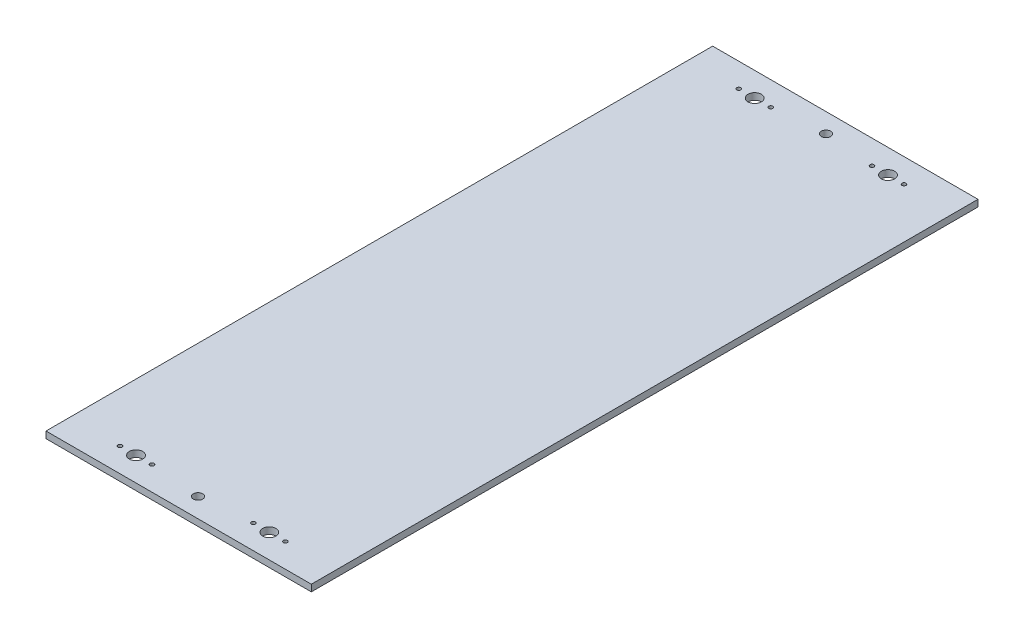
ISO-10303-21;
HEADER;
FILE_DESCRIPTION(('STEP AP214'),'2;1');
FILE_NAME('part.step','',(''),(''),'','','');
FILE_SCHEMA(('AUTOMOTIVE_DESIGN { 1 0 10303 214 1 1 1 1 }'));
ENDSEC;
DATA;
#1=APPLICATION_CONTEXT('core data for automotive mechanical design processes');
#2=APPLICATION_PROTOCOL_DEFINITION('international standard','automotive_design',2000,#1);
#3=PRODUCT_CONTEXT('',#1,'mechanical');
#4=PRODUCT('Part','Part','',(#3));
#5=PRODUCT_RELATED_PRODUCT_CATEGORY('part','',(#4));
#6=PRODUCT_DEFINITION_FORMATION('','',#4);
#7=PRODUCT_DEFINITION_CONTEXT('part definition',#1,'design');
#8=PRODUCT_DEFINITION('design','',#6,#7);
#9=PRODUCT_DEFINITION_SHAPE('','',#8);
#10=(LENGTH_UNIT() NAMED_UNIT(*) SI_UNIT(.MILLI.,.METRE.));
#11=(NAMED_UNIT(*) PLANE_ANGLE_UNIT() SI_UNIT($,.RADIAN.));
#12=(NAMED_UNIT(*) SI_UNIT($,.STERADIAN.) SOLID_ANGLE_UNIT());
#13=UNCERTAINTY_MEASURE_WITH_UNIT(LENGTH_MEASURE(1.E-05),#10,'distance_accuracy_value','');
#14=(GEOMETRIC_REPRESENTATION_CONTEXT(3) GLOBAL_UNCERTAINTY_ASSIGNED_CONTEXT((#13)) GLOBAL_UNIT_ASSIGNED_CONTEXT((#10,
#11,#12)) REPRESENTATION_CONTEXT('',''));
#15=CARTESIAN_POINT('',(0.,0.,0.));
#16=DIRECTION('',(0.,0.,1.));
#17=DIRECTION('',(1.,0.,0.));
#18=AXIS2_PLACEMENT_3D('',#15,#16,#17);
#19=CARTESIAN_POINT('',(-199.,10.,-500.));
#20=DIRECTION('',(1.,0.,0.));
#21=DIRECTION('',(0.,0.,-1.));
#22=AXIS2_PLACEMENT_3D('',#19,#20,#21);
#23=PLANE('',#22);
#24=DIRECTION('',(0.,0.,1.));
#25=VECTOR('',#24,1.);
#26=CARTESIAN_POINT('',(-199.,0.,-500.));
#27=LINE('',#26,#25);
#28=CARTESIAN_POINT('',(-199.,0.,-500.));
#29=VERTEX_POINT('',#28);
#30=CARTESIAN_POINT('',(-199.,0.,500.));
#31=VERTEX_POINT('',#30);
#32=EDGE_CURVE('E98',#29,#31,#27,.T.);
#33=ORIENTED_EDGE('',*,*,#32,.T.);
#34=DIRECTION('',(0.,-1.,0.));
#35=VECTOR('',#34,1.);
#36=CARTESIAN_POINT('',(-199.,10.,500.));
#37=LINE('',#36,#35);
#38=CARTESIAN_POINT('',(-199.,10.,500.));
#39=VERTEX_POINT('',#38);
#40=EDGE_CURVE('E11',#39,#31,#37,.T.);
#41=ORIENTED_EDGE('',*,*,#40,.F.);
#42=DIRECTION('',(0.,0.,1.));
#43=VECTOR('',#42,1.);
#44=CARTESIAN_POINT('',(-199.,10.,-500.));
#45=LINE('',#44,#43);
#46=CARTESIAN_POINT('',(-199.,10.,-500.));
#47=VERTEX_POINT('',#46);
#48=EDGE_CURVE('E86',#47,#39,#45,.T.);
#49=ORIENTED_EDGE('',*,*,#48,.F.);
#50=DIRECTION('',(0.,-1.,0.));
#51=VECTOR('',#50,1.);
#52=CARTESIAN_POINT('',(-199.,10.,-500.));
#53=LINE('',#52,#51);
#54=EDGE_CURVE('E94',#47,#29,#53,.T.);
#55=ORIENTED_EDGE('',*,*,#54,.T.);
#56=EDGE_LOOP('',(#33,#41,#49,#55));
#57=FACE_BOUND('',#56,.T.);
#58=ADVANCED_FACE('F35',(#57),#23,.F.);
#59=CARTESIAN_POINT('',(199.,10.,500.));
#60=DIRECTION('',(0.,0.,-1.));
#61=DIRECTION('',(-1.,0.,0.));
#62=AXIS2_PLACEMENT_3D('',#59,#60,#61);
#63=PLANE('',#62);
#64=DIRECTION('',(1.,0.,0.));
#65=VECTOR('',#64,1.);
#66=CARTESIAN_POINT('',(199.,0.,500.));
#67=LINE('',#66,#65);
#68=CARTESIAN_POINT('',(199.,0.,500.));
#69=VERTEX_POINT('',#68);
#70=EDGE_CURVE('E90',#31,#69,#67,.T.);
#71=ORIENTED_EDGE('',*,*,#70,.T.);
#72=DIRECTION('',(0.,-1.,0.));
#73=VECTOR('',#72,1.);
#74=CARTESIAN_POINT('',(199.,10.,500.));
#75=LINE('',#74,#73);
#76=CARTESIAN_POINT('',(199.,10.,500.));
#77=VERTEX_POINT('',#76);
#78=EDGE_CURVE('E43',#77,#69,#75,.T.);
#79=ORIENTED_EDGE('',*,*,#78,.F.);
#80=DIRECTION('',(1.,0.,0.));
#81=VECTOR('',#80,1.);
#82=CARTESIAN_POINT('',(199.,10.,500.));
#83=LINE('',#82,#81);
#84=EDGE_CURVE('E81',#39,#77,#83,.T.);
#85=ORIENTED_EDGE('',*,*,#84,.F.);
#86=ORIENTED_EDGE('',*,*,#40,.T.);
#87=EDGE_LOOP('',(#71,#79,#85,#86));
#88=FACE_BOUND('',#87,.T.);
#89=ADVANCED_FACE('F89',(#88),#63,.F.);
#90=CARTESIAN_POINT('',(199.,10.,-500.));
#91=DIRECTION('',(-1.,0.,0.));
#92=DIRECTION('',(0.,0.,1.));
#93=AXIS2_PLACEMENT_3D('',#90,#91,#92);
#94=PLANE('',#93);
#95=DIRECTION('',(0.,0.,-1.));
#96=VECTOR('',#95,1.);
#97=CARTESIAN_POINT('',(199.,0.,-500.));
#98=LINE('',#97,#96);
#99=CARTESIAN_POINT('',(199.,0.,-500.));
#100=VERTEX_POINT('',#99);
#101=EDGE_CURVE('E68',#69,#100,#98,.T.);
#102=ORIENTED_EDGE('',*,*,#101,.T.);
#103=DIRECTION('',(0.,-1.,0.));
#104=VECTOR('',#103,1.);
#105=CARTESIAN_POINT('',(199.,10.,-500.));
#106=LINE('',#105,#104);
#107=CARTESIAN_POINT('',(199.,10.,-500.));
#108=VERTEX_POINT('',#107);
#109=EDGE_CURVE('E91',#108,#100,#106,.T.);
#110=ORIENTED_EDGE('',*,*,#109,.F.);
#111=DIRECTION('',(0.,0.,-1.));
#112=VECTOR('',#111,1.);
#113=CARTESIAN_POINT('',(199.,10.,-500.));
#114=LINE('',#113,#112);
#115=EDGE_CURVE('E84',#77,#108,#114,.T.);
#116=ORIENTED_EDGE('',*,*,#115,.F.);
#117=ORIENTED_EDGE('',*,*,#78,.T.);
#118=EDGE_LOOP('',(#102,#110,#116,#117));
#119=FACE_BOUND('',#118,.T.);
#120=ADVANCED_FACE('F92',(#119),#94,.F.);
#121=CARTESIAN_POINT('',(199.,10.,-500.));
#122=DIRECTION('',(0.,0.,1.));
#123=DIRECTION('',(1.,0.,0.));
#124=AXIS2_PLACEMENT_3D('',#121,#122,#123);
#125=PLANE('',#124);
#126=DIRECTION('',(-1.,0.,0.));
#127=VECTOR('',#126,1.);
#128=CARTESIAN_POINT('',(199.,0.,-500.));
#129=LINE('',#128,#127);
#130=EDGE_CURVE('E74',#100,#29,#129,.T.);
#131=ORIENTED_EDGE('',*,*,#130,.T.);
#132=ORIENTED_EDGE('',*,*,#54,.F.);
#133=DIRECTION('',(-1.,0.,0.));
#134=VECTOR('',#133,1.);
#135=CARTESIAN_POINT('',(199.,10.,-500.));
#136=LINE('',#135,#134);
#137=EDGE_CURVE('E51',#108,#47,#136,.T.);
#138=ORIENTED_EDGE('',*,*,#137,.F.);
#139=ORIENTED_EDGE('',*,*,#109,.T.);
#140=EDGE_LOOP('',(#131,#132,#138,#139));
#141=FACE_BOUND('',#140,.T.);
#142=ADVANCED_FACE('F106',(#141),#125,.F.);
#143=CARTESIAN_POINT('',(0.,10.,0.));
#144=DIRECTION('',(0.,-1.,0.));
#145=DIRECTION('',(0.,0.,-1.));
#146=AXIS2_PLACEMENT_3D('',#143,#144,#145);
#147=PLANE('',#146);
#148=CARTESIAN_POINT('',(124.,10.,-464.));
#149=DIRECTION('',(0.,1.,0.));
#150=DIRECTION('',(0.,0.,1.));
#151=AXIS2_PLACEMENT_3D('',#148,#149,#150);
#152=CIRCLE('',#151,2.99999999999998);
#153=CARTESIAN_POINT('',(124.,10.,-461.));
#154=VERTEX_POINT('',#153);
#155=EDGE_CURVE('E137',#154,#154,#152,.T.);
#156=ORIENTED_EDGE('',*,*,#155,.F.);
#157=EDGE_LOOP('',(#156));
#158=FACE_BOUND('',#157,.T.);
#159=CARTESIAN_POINT('',(76.0000000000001,10.,-464.));
#160=DIRECTION('',(0.,1.,0.));
#161=DIRECTION('',(0.,0.,1.));
#162=AXIS2_PLACEMENT_3D('',#159,#160,#161);
#163=CIRCLE('',#162,3.00000000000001);
#164=CARTESIAN_POINT('',(76.0000000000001,10.,-461.));
#165=VERTEX_POINT('',#164);
#166=EDGE_CURVE('E184',#165,#165,#163,.T.);
#167=ORIENTED_EDGE('',*,*,#166,.F.);
#168=EDGE_LOOP('',(#167));
#169=FACE_BOUND('',#168,.T.);
#170=CARTESIAN_POINT('',(-76.0000000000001,10.,-464.));
#171=DIRECTION('',(0.,1.,0.));
#172=DIRECTION('',(0.,0.,1.));
#173=AXIS2_PLACEMENT_3D('',#170,#171,#172);
#174=CIRCLE('',#173,2.99999999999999);
#175=CARTESIAN_POINT('',(-76.0000000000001,10.,-461.));
#176=VERTEX_POINT('',#175);
#177=EDGE_CURVE('E190',#176,#176,#174,.T.);
#178=ORIENTED_EDGE('',*,*,#177,.F.);
#179=EDGE_LOOP('',(#178));
#180=FACE_BOUND('',#179,.T.);
#181=CARTESIAN_POINT('',(-124.,10.,-464.));
#182=DIRECTION('',(0.,1.,0.));
#183=DIRECTION('',(0.,0.,1.));
#184=AXIS2_PLACEMENT_3D('',#181,#182,#183);
#185=CIRCLE('',#184,2.99999999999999);
#186=CARTESIAN_POINT('',(-124.,10.,-461.));
#187=VERTEX_POINT('',#186);
#188=EDGE_CURVE('E161',#187,#187,#185,.T.);
#189=ORIENTED_EDGE('',*,*,#188,.F.);
#190=EDGE_LOOP('',(#189));
#191=FACE_BOUND('',#190,.T.);
#192=CARTESIAN_POINT('',(0.,10.,-471.));
#193=DIRECTION('',(0.,1.,0.));
#194=DIRECTION('',(0.,0.,1.));
#195=AXIS2_PLACEMENT_3D('',#192,#193,#194);
#196=CIRCLE('',#195,7.);
#197=CARTESIAN_POINT('',(0.,10.,-464.));
#198=VERTEX_POINT('',#197);
#199=EDGE_CURVE('E168',#198,#198,#196,.T.);
#200=ORIENTED_EDGE('',*,*,#199,.F.);
#201=EDGE_LOOP('',(#200));
#202=FACE_BOUND('',#201,.T.);
#203=CARTESIAN_POINT('',(100.,10.,-464.));
#204=DIRECTION('',(0.,1.,0.));
#205=DIRECTION('',(0.,0.,1.));
#206=AXIS2_PLACEMENT_3D('',#203,#204,#205);
#207=CIRCLE('',#206,10.);
#208=CARTESIAN_POINT('',(100.,10.,-454.));
#209=VERTEX_POINT('',#208);
#210=EDGE_CURVE('E174',#209,#209,#207,.T.);
#211=ORIENTED_EDGE('',*,*,#210,.F.);
#212=EDGE_LOOP('',(#211));
#213=FACE_BOUND('',#212,.T.);
#214=CARTESIAN_POINT('',(-124.,10.,464.));
#215=DIRECTION('',(0.,1.,0.));
#216=DIRECTION('',(0.,0.,-1.));
#217=AXIS2_PLACEMENT_3D('',#214,#215,#216);
#218=CIRCLE('',#217,2.99999999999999);
#219=CARTESIAN_POINT('',(-124.,10.,461.));
#220=VERTEX_POINT('',#219);
#221=EDGE_CURVE('E145',#220,#220,#218,.T.);
#222=ORIENTED_EDGE('',*,*,#221,.F.);
#223=EDGE_LOOP('',(#222));
#224=FACE_BOUND('',#223,.T.);
#225=CARTESIAN_POINT('',(0.,10.,471.));
#226=DIRECTION('',(0.,1.,0.));
#227=DIRECTION('',(0.,0.,-1.));
#228=AXIS2_PLACEMENT_3D('',#225,#226,#227);
#229=CIRCLE('',#228,7.);
#230=CARTESIAN_POINT('',(0.,10.,464.));
#231=VERTEX_POINT('',#230);
#232=EDGE_CURVE('E138',#231,#231,#229,.T.);
#233=ORIENTED_EDGE('',*,*,#232,.F.);
#234=EDGE_LOOP('',(#233));
#235=FACE_BOUND('',#234,.T.);
#236=CARTESIAN_POINT('',(100.,10.,464.));
#237=DIRECTION('',(0.,1.,0.));
#238=DIRECTION('',(0.,0.,-1.));
#239=AXIS2_PLACEMENT_3D('',#236,#237,#238);
#240=CIRCLE('',#239,10.);
#241=CARTESIAN_POINT('',(100.,10.,454.));
#242=VERTEX_POINT('',#241);
#243=EDGE_CURVE('E156',#242,#242,#240,.T.);
#244=ORIENTED_EDGE('',*,*,#243,.F.);
#245=EDGE_LOOP('',(#244));
#246=FACE_BOUND('',#245,.T.);
#247=CARTESIAN_POINT('',(-99.9999999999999,10.,464.));
#248=DIRECTION('',(0.,1.,0.));
#249=DIRECTION('',(0.,0.,-1.));
#250=AXIS2_PLACEMENT_3D('',#247,#248,#249);
#251=CIRCLE('',#250,10.);
#252=CARTESIAN_POINT('',(-99.9999999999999,10.,454.));
#253=VERTEX_POINT('',#252);
#254=EDGE_CURVE('E150',#253,#253,#251,.T.);
#255=ORIENTED_EDGE('',*,*,#254,.F.);
#256=EDGE_LOOP('',(#255));
#257=FACE_BOUND('',#256,.T.);
#258=CARTESIAN_POINT('',(-76.0000000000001,10.,464.));
#259=DIRECTION('',(0.,1.,0.));
#260=DIRECTION('',(0.,0.,-1.));
#261=AXIS2_PLACEMENT_3D('',#258,#259,#260);
#262=CIRCLE('',#261,2.99999999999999);
#263=CARTESIAN_POINT('',(-76.0000000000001,10.,461.));
#264=VERTEX_POINT('',#263);
#265=EDGE_CURVE('E118',#264,#264,#262,.T.);
#266=ORIENTED_EDGE('',*,*,#265,.F.);
#267=EDGE_LOOP('',(#266));
#268=FACE_BOUND('',#267,.T.);
#269=CARTESIAN_POINT('',(76.0000000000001,10.,464.));
#270=DIRECTION('',(0.,1.,0.));
#271=DIRECTION('',(0.,0.,-1.));
#272=AXIS2_PLACEMENT_3D('',#269,#270,#271);
#273=CIRCLE('',#272,3.00000000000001);
#274=CARTESIAN_POINT('',(76.0000000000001,10.,461.));
#275=VERTEX_POINT('',#274);
#276=EDGE_CURVE('E125',#275,#275,#273,.T.);
#277=ORIENTED_EDGE('',*,*,#276,.F.);
#278=EDGE_LOOP('',(#277));
#279=FACE_BOUND('',#278,.T.);
#280=CARTESIAN_POINT('',(124.,10.,464.));
#281=DIRECTION('',(0.,1.,0.));
#282=DIRECTION('',(0.,0.,-1.));
#283=AXIS2_PLACEMENT_3D('',#280,#281,#282);
#284=CIRCLE('',#283,2.99999999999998);
#285=CARTESIAN_POINT('',(124.,10.,461.));
#286=VERTEX_POINT('',#285);
#287=EDGE_CURVE('E131',#286,#286,#284,.T.);
#288=ORIENTED_EDGE('',*,*,#287,.F.);
#289=EDGE_LOOP('',(#288));
#290=FACE_BOUND('',#289,.T.);
#291=CARTESIAN_POINT('',(-99.9999999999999,10.,-464.));
#292=DIRECTION('',(0.,1.,0.));
#293=DIRECTION('',(0.,0.,1.));
#294=AXIS2_PLACEMENT_3D('',#291,#292,#293);
#295=CIRCLE('',#294,10.);
#296=CARTESIAN_POINT('',(-99.9999999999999,10.,-454.));
#297=VERTEX_POINT('',#296);
#298=EDGE_CURVE('E112',#297,#297,#295,.T.);
#299=ORIENTED_EDGE('',*,*,#298,.F.);
#300=EDGE_LOOP('',(#299));
#301=FACE_BOUND('',#300,.T.);
#302=ORIENTED_EDGE('',*,*,#48,.T.);
#303=ORIENTED_EDGE('',*,*,#84,.T.);
#304=ORIENTED_EDGE('',*,*,#115,.T.);
#305=ORIENTED_EDGE('',*,*,#137,.T.);
#306=EDGE_LOOP('',(#302,#303,#304,#305));
#307=FACE_BOUND('',#306,.T.);
#308=ADVANCED_FACE('F82',(#158,#169,#180,#191,#202,#213,#224,#235,#246,#257,#268,#279,#290,#301,
#307),#147,.F.);
#309=CARTESIAN_POINT('',(0.,0.,0.));
#310=DIRECTION('',(0.,-1.,0.));
#311=DIRECTION('',(0.,0.,-1.));
#312=AXIS2_PLACEMENT_3D('',#309,#310,#311);
#313=PLANE('',#312);
#314=CARTESIAN_POINT('',(124.,0.,-464.));
#315=DIRECTION('',(0.,1.,0.));
#316=DIRECTION('',(0.,0.,1.));
#317=AXIS2_PLACEMENT_3D('',#314,#315,#316);
#318=CIRCLE('',#317,2.99999999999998);
#319=CARTESIAN_POINT('',(124.,0.,-461.));
#320=VERTEX_POINT('',#319);
#321=EDGE_CURVE('E181',#320,#320,#318,.T.);
#322=ORIENTED_EDGE('',*,*,#321,.T.);
#323=EDGE_LOOP('',(#322));
#324=FACE_BOUND('',#323,.T.);
#325=CARTESIAN_POINT('',(76.0000000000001,0.,-464.));
#326=DIRECTION('',(0.,1.,0.));
#327=DIRECTION('',(0.,0.,1.));
#328=AXIS2_PLACEMENT_3D('',#325,#326,#327);
#329=CIRCLE('',#328,3.00000000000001);
#330=CARTESIAN_POINT('',(76.0000000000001,0.,-461.));
#331=VERTEX_POINT('',#330);
#332=EDGE_CURVE('E187',#331,#331,#329,.T.);
#333=ORIENTED_EDGE('',*,*,#332,.T.);
#334=EDGE_LOOP('',(#333));
#335=FACE_BOUND('',#334,.T.);
#336=CARTESIAN_POINT('',(-76.0000000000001,0.,-464.));
#337=DIRECTION('',(0.,1.,0.));
#338=DIRECTION('',(0.,0.,1.));
#339=AXIS2_PLACEMENT_3D('',#336,#337,#338);
#340=CIRCLE('',#339,2.99999999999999);
#341=CARTESIAN_POINT('',(-76.0000000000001,0.,-461.));
#342=VERTEX_POINT('',#341);
#343=EDGE_CURVE('E165',#342,#342,#340,.T.);
#344=ORIENTED_EDGE('',*,*,#343,.T.);
#345=EDGE_LOOP('',(#344));
#346=FACE_BOUND('',#345,.T.);
#347=CARTESIAN_POINT('',(-124.,0.,-464.));
#348=DIRECTION('',(0.,1.,0.));
#349=DIRECTION('',(0.,0.,1.));
#350=AXIS2_PLACEMENT_3D('',#347,#348,#349);
#351=CIRCLE('',#350,2.99999999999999);
#352=CARTESIAN_POINT('',(-124.,0.,-461.));
#353=VERTEX_POINT('',#352);
#354=EDGE_CURVE('E164',#353,#353,#351,.T.);
#355=ORIENTED_EDGE('',*,*,#354,.T.);
#356=EDGE_LOOP('',(#355));
#357=FACE_BOUND('',#356,.T.);
#358=CARTESIAN_POINT('',(0.,0.,-471.));
#359=DIRECTION('',(0.,1.,0.));
#360=DIRECTION('',(0.,0.,1.));
#361=AXIS2_PLACEMENT_3D('',#358,#359,#360);
#362=CIRCLE('',#361,7.);
#363=CARTESIAN_POINT('',(0.,0.,-464.));
#364=VERTEX_POINT('',#363);
#365=EDGE_CURVE('E171',#364,#364,#362,.T.);
#366=ORIENTED_EDGE('',*,*,#365,.T.);
#367=EDGE_LOOP('',(#366));
#368=FACE_BOUND('',#367,.T.);
#369=CARTESIAN_POINT('',(100.,0.,-464.));
#370=DIRECTION('',(0.,1.,0.));
#371=DIRECTION('',(0.,0.,1.));
#372=AXIS2_PLACEMENT_3D('',#369,#370,#371);
#373=CIRCLE('',#372,10.);
#374=CARTESIAN_POINT('',(100.,0.,-454.));
#375=VERTEX_POINT('',#374);
#376=EDGE_CURVE('E115',#375,#375,#373,.T.);
#377=ORIENTED_EDGE('',*,*,#376,.T.);
#378=EDGE_LOOP('',(#377));
#379=FACE_BOUND('',#378,.T.);
#380=CARTESIAN_POINT('',(-124.,0.,464.));
#381=DIRECTION('',(0.,1.,0.));
#382=DIRECTION('',(0.,0.,-1.));
#383=AXIS2_PLACEMENT_3D('',#380,#381,#382);
#384=CIRCLE('',#383,2.99999999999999);
#385=CARTESIAN_POINT('',(-124.,0.,461.));
#386=VERTEX_POINT('',#385);
#387=EDGE_CURVE('E122',#386,#386,#384,.T.);
#388=ORIENTED_EDGE('',*,*,#387,.T.);
#389=EDGE_LOOP('',(#388));
#390=FACE_BOUND('',#389,.T.);
#391=CARTESIAN_POINT('',(0.,0.,471.));
#392=DIRECTION('',(0.,1.,0.));
#393=DIRECTION('',(0.,0.,-1.));
#394=AXIS2_PLACEMENT_3D('',#391,#392,#393);
#395=CIRCLE('',#394,7.);
#396=CARTESIAN_POINT('',(0.,0.,464.));
#397=VERTEX_POINT('',#396);
#398=EDGE_CURVE('E141',#397,#397,#395,.T.);
#399=ORIENTED_EDGE('',*,*,#398,.T.);
#400=EDGE_LOOP('',(#399));
#401=FACE_BOUND('',#400,.T.);
#402=CARTESIAN_POINT('',(100.,0.,464.));
#403=DIRECTION('',(0.,1.,0.));
#404=DIRECTION('',(0.,0.,-1.));
#405=AXIS2_PLACEMENT_3D('',#402,#403,#404);
#406=CIRCLE('',#405,10.);
#407=CARTESIAN_POINT('',(100.,0.,454.));
#408=VERTEX_POINT('',#407);
#409=EDGE_CURVE('E142',#408,#408,#406,.T.);
#410=ORIENTED_EDGE('',*,*,#409,.T.);
#411=EDGE_LOOP('',(#410));
#412=FACE_BOUND('',#411,.T.);
#413=CARTESIAN_POINT('',(-99.9999999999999,0.,464.));
#414=DIRECTION('',(0.,1.,0.));
#415=DIRECTION('',(0.,0.,-1.));
#416=AXIS2_PLACEMENT_3D('',#413,#414,#415);
#417=CIRCLE('',#416,10.);
#418=CARTESIAN_POINT('',(-99.9999999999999,0.,454.));
#419=VERTEX_POINT('',#418);
#420=EDGE_CURVE('E153',#419,#419,#417,.T.);
#421=ORIENTED_EDGE('',*,*,#420,.T.);
#422=EDGE_LOOP('',(#421));
#423=FACE_BOUND('',#422,.T.);
#424=CARTESIAN_POINT('',(-76.0000000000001,0.,464.));
#425=DIRECTION('',(0.,1.,0.));
#426=DIRECTION('',(0.,0.,-1.));
#427=AXIS2_PLACEMENT_3D('',#424,#425,#426);
#428=CIRCLE('',#427,2.99999999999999);
#429=CARTESIAN_POINT('',(-76.0000000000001,0.,461.));
#430=VERTEX_POINT('',#429);
#431=EDGE_CURVE('E121',#430,#430,#428,.T.);
#432=ORIENTED_EDGE('',*,*,#431,.T.);
#433=EDGE_LOOP('',(#432));
#434=FACE_BOUND('',#433,.T.);
#435=CARTESIAN_POINT('',(76.0000000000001,0.,464.));
#436=DIRECTION('',(0.,1.,0.));
#437=DIRECTION('',(0.,0.,-1.));
#438=AXIS2_PLACEMENT_3D('',#435,#436,#437);
#439=CIRCLE('',#438,3.00000000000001);
#440=CARTESIAN_POINT('',(76.0000000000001,0.,461.));
#441=VERTEX_POINT('',#440);
#442=EDGE_CURVE('E128',#441,#441,#439,.T.);
#443=ORIENTED_EDGE('',*,*,#442,.T.);
#444=EDGE_LOOP('',(#443));
#445=FACE_BOUND('',#444,.T.);
#446=CARTESIAN_POINT('',(124.,0.,464.));
#447=DIRECTION('',(0.,1.,0.));
#448=DIRECTION('',(0.,0.,-1.));
#449=AXIS2_PLACEMENT_3D('',#446,#447,#448);
#450=CIRCLE('',#449,2.99999999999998);
#451=CARTESIAN_POINT('',(124.,0.,461.));
#452=VERTEX_POINT('',#451);
#453=EDGE_CURVE('E134',#452,#452,#450,.T.);
#454=ORIENTED_EDGE('',*,*,#453,.T.);
#455=EDGE_LOOP('',(#454));
#456=FACE_BOUND('',#455,.T.);
#457=CARTESIAN_POINT('',(-99.9999999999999,0.,-464.));
#458=DIRECTION('',(0.,1.,0.));
#459=DIRECTION('',(0.,0.,1.));
#460=AXIS2_PLACEMENT_3D('',#457,#458,#459);
#461=CIRCLE('',#460,10.);
#462=CARTESIAN_POINT('',(-99.9999999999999,0.,-454.));
#463=VERTEX_POINT('',#462);
#464=EDGE_CURVE('E101',#463,#463,#461,.T.);
#465=ORIENTED_EDGE('',*,*,#464,.T.);
#466=EDGE_LOOP('',(#465));
#467=FACE_BOUND('',#466,.T.);
#468=ORIENTED_EDGE('',*,*,#32,.F.);
#469=ORIENTED_EDGE('',*,*,#130,.F.);
#470=ORIENTED_EDGE('',*,*,#101,.F.);
#471=ORIENTED_EDGE('',*,*,#70,.F.);
#472=EDGE_LOOP('',(#468,#469,#470,#471));
#473=FACE_BOUND('',#472,.T.);
#474=ADVANCED_FACE('F109',(#324,#335,#346,#357,#368,#379,#390,#401,#412,#423,#434,#445,#456,
#467,#473),#313,.T.);
#475=CARTESIAN_POINT('',(-99.9999999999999,0.,-464.));
#476=DIRECTION('',(0.,1.,0.));
#477=DIRECTION('',(0.,0.,1.));
#478=AXIS2_PLACEMENT_3D('',#475,#476,#477);
#479=CYLINDRICAL_SURFACE('',#478,10.);
#480=ORIENTED_EDGE('',*,*,#464,.F.);
#481=EDGE_LOOP('',(#480));
#482=FACE_BOUND('',#481,.T.);
#483=ORIENTED_EDGE('',*,*,#298,.T.);
#484=EDGE_LOOP('',(#483));
#485=FACE_BOUND('',#484,.T.);
#486=ADVANCED_FACE('F232',(#482,#485),#479,.F.);
#487=CARTESIAN_POINT('',(124.,0.,464.));
#488=DIRECTION('',(0.,1.,0.));
#489=DIRECTION('',(0.,0.,1.));
#490=AXIS2_PLACEMENT_3D('',#487,#488,#489);
#491=CYLINDRICAL_SURFACE('',#490,2.99999999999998);
#492=ORIENTED_EDGE('',*,*,#453,.F.);
#493=EDGE_LOOP('',(#492));
#494=FACE_BOUND('',#493,.T.);
#495=ORIENTED_EDGE('',*,*,#287,.T.);
#496=EDGE_LOOP('',(#495));
#497=FACE_BOUND('',#496,.T.);
#498=ADVANCED_FACE('F234',(#494,#497),#491,.F.);
#499=CARTESIAN_POINT('',(76.0000000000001,0.,464.));
#500=DIRECTION('',(0.,1.,0.));
#501=DIRECTION('',(0.,0.,1.));
#502=AXIS2_PLACEMENT_3D('',#499,#500,#501);
#503=CYLINDRICAL_SURFACE('',#502,3.00000000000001);
#504=ORIENTED_EDGE('',*,*,#442,.F.);
#505=EDGE_LOOP('',(#504));
#506=FACE_BOUND('',#505,.T.);
#507=ORIENTED_EDGE('',*,*,#276,.T.);
#508=EDGE_LOOP('',(#507));
#509=FACE_BOUND('',#508,.T.);
#510=ADVANCED_FACE('F241',(#506,#509),#503,.F.);
#511=CARTESIAN_POINT('',(-76.0000000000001,0.,464.));
#512=DIRECTION('',(0.,1.,0.));
#513=DIRECTION('',(0.,0.,1.));
#514=AXIS2_PLACEMENT_3D('',#511,#512,#513);
#515=CYLINDRICAL_SURFACE('',#514,2.99999999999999);
#516=ORIENTED_EDGE('',*,*,#431,.F.);
#517=EDGE_LOOP('',(#516));
#518=FACE_BOUND('',#517,.T.);
#519=ORIENTED_EDGE('',*,*,#265,.T.);
#520=EDGE_LOOP('',(#519));
#521=FACE_BOUND('',#520,.T.);
#522=ADVANCED_FACE('F289',(#518,#521),#515,.F.);
#523=CARTESIAN_POINT('',(-99.9999999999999,0.,464.));
#524=DIRECTION('',(0.,1.,0.));
#525=DIRECTION('',(0.,0.,1.));
#526=AXIS2_PLACEMENT_3D('',#523,#524,#525);
#527=CYLINDRICAL_SURFACE('',#526,10.);
#528=ORIENTED_EDGE('',*,*,#420,.F.);
#529=EDGE_LOOP('',(#528));
#530=FACE_BOUND('',#529,.T.);
#531=ORIENTED_EDGE('',*,*,#254,.T.);
#532=EDGE_LOOP('',(#531));
#533=FACE_BOUND('',#532,.T.);
#534=ADVANCED_FACE('F299',(#530,#533),#527,.F.);
#535=CARTESIAN_POINT('',(100.,0.,464.));
#536=DIRECTION('',(0.,1.,0.));
#537=DIRECTION('',(0.,0.,1.));
#538=AXIS2_PLACEMENT_3D('',#535,#536,#537);
#539=CYLINDRICAL_SURFACE('',#538,10.);
#540=ORIENTED_EDGE('',*,*,#409,.F.);
#541=EDGE_LOOP('',(#540));
#542=FACE_BOUND('',#541,.T.);
#543=ORIENTED_EDGE('',*,*,#243,.T.);
#544=EDGE_LOOP('',(#543));
#545=FACE_BOUND('',#544,.T.);
#546=ADVANCED_FACE('F308',(#542,#545),#539,.F.);
#547=CARTESIAN_POINT('',(0.,0.,471.));
#548=DIRECTION('',(0.,1.,0.));
#549=DIRECTION('',(0.,0.,1.));
#550=AXIS2_PLACEMENT_3D('',#547,#548,#549);
#551=CYLINDRICAL_SURFACE('',#550,7.);
#552=ORIENTED_EDGE('',*,*,#398,.F.);
#553=EDGE_LOOP('',(#552));
#554=FACE_BOUND('',#553,.T.);
#555=ORIENTED_EDGE('',*,*,#232,.T.);
#556=EDGE_LOOP('',(#555));
#557=FACE_BOUND('',#556,.T.);
#558=ADVANCED_FACE('F318',(#554,#557),#551,.F.);
#559=CARTESIAN_POINT('',(-124.,0.,464.));
#560=DIRECTION('',(0.,1.,0.));
#561=DIRECTION('',(0.,0.,1.));
#562=AXIS2_PLACEMENT_3D('',#559,#560,#561);
#563=CYLINDRICAL_SURFACE('',#562,2.99999999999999);
#564=ORIENTED_EDGE('',*,*,#387,.F.);
#565=EDGE_LOOP('',(#564));
#566=FACE_BOUND('',#565,.T.);
#567=ORIENTED_EDGE('',*,*,#221,.T.);
#568=EDGE_LOOP('',(#567));
#569=FACE_BOUND('',#568,.T.);
#570=ADVANCED_FACE('F328',(#566,#569),#563,.F.);
#571=CARTESIAN_POINT('',(100.,0.,-464.));
#572=DIRECTION('',(0.,1.,0.));
#573=DIRECTION('',(0.,0.,1.));
#574=AXIS2_PLACEMENT_3D('',#571,#572,#573);
#575=CYLINDRICAL_SURFACE('',#574,10.);
#576=ORIENTED_EDGE('',*,*,#376,.F.);
#577=EDGE_LOOP('',(#576));
#578=FACE_BOUND('',#577,.T.);
#579=ORIENTED_EDGE('',*,*,#210,.T.);
#580=EDGE_LOOP('',(#579));
#581=FACE_BOUND('',#580,.T.);
#582=ADVANCED_FACE('F338',(#578,#581),#575,.F.);
#583=CARTESIAN_POINT('',(0.,0.,-471.));
#584=DIRECTION('',(0.,1.,0.));
#585=DIRECTION('',(0.,0.,1.));
#586=AXIS2_PLACEMENT_3D('',#583,#584,#585);
#587=CYLINDRICAL_SURFACE('',#586,7.);
#588=ORIENTED_EDGE('',*,*,#365,.F.);
#589=EDGE_LOOP('',(#588));
#590=FACE_BOUND('',#589,.T.);
#591=ORIENTED_EDGE('',*,*,#199,.T.);
#592=EDGE_LOOP('',(#591));
#593=FACE_BOUND('',#592,.T.);
#594=ADVANCED_FACE('F348',(#590,#593),#587,.F.);
#595=CARTESIAN_POINT('',(-124.,0.,-464.));
#596=DIRECTION('',(0.,1.,0.));
#597=DIRECTION('',(0.,0.,1.));
#598=AXIS2_PLACEMENT_3D('',#595,#596,#597);
#599=CYLINDRICAL_SURFACE('',#598,2.99999999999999);
#600=ORIENTED_EDGE('',*,*,#354,.F.);
#601=EDGE_LOOP('',(#600));
#602=FACE_BOUND('',#601,.T.);
#603=ORIENTED_EDGE('',*,*,#188,.T.);
#604=EDGE_LOOP('',(#603));
#605=FACE_BOUND('',#604,.T.);
#606=ADVANCED_FACE('F202',(#602,#605),#599,.F.);
#607=CARTESIAN_POINT('',(-76.0000000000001,0.,-464.));
#608=DIRECTION('',(0.,1.,0.));
#609=DIRECTION('',(0.,0.,1.));
#610=AXIS2_PLACEMENT_3D('',#607,#608,#609);
#611=CYLINDRICAL_SURFACE('',#610,2.99999999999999);
#612=ORIENTED_EDGE('',*,*,#343,.F.);
#613=EDGE_LOOP('',(#612));
#614=FACE_BOUND('',#613,.T.);
#615=ORIENTED_EDGE('',*,*,#177,.T.);
#616=EDGE_LOOP('',(#615));
#617=FACE_BOUND('',#616,.T.);
#618=ADVANCED_FACE('F198',(#614,#617),#611,.F.);
#619=CARTESIAN_POINT('',(76.0000000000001,0.,-464.));
#620=DIRECTION('',(0.,1.,0.));
#621=DIRECTION('',(0.,0.,1.));
#622=AXIS2_PLACEMENT_3D('',#619,#620,#621);
#623=CYLINDRICAL_SURFACE('',#622,3.00000000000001);
#624=ORIENTED_EDGE('',*,*,#332,.F.);
#625=EDGE_LOOP('',(#624));
#626=FACE_BOUND('',#625,.T.);
#627=ORIENTED_EDGE('',*,*,#166,.T.);
#628=EDGE_LOOP('',(#627));
#629=FACE_BOUND('',#628,.T.);
#630=ADVANCED_FACE('F201',(#626,#629),#623,.F.);
#631=CARTESIAN_POINT('',(124.,0.,-464.));
#632=DIRECTION('',(0.,1.,0.));
#633=DIRECTION('',(0.,0.,1.));
#634=AXIS2_PLACEMENT_3D('',#631,#632,#633);
#635=CYLINDRICAL_SURFACE('',#634,2.99999999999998);
#636=ORIENTED_EDGE('',*,*,#321,.F.);
#637=EDGE_LOOP('',(#636));
#638=FACE_BOUND('',#637,.T.);
#639=ORIENTED_EDGE('',*,*,#155,.T.);
#640=EDGE_LOOP('',(#639));
#641=FACE_BOUND('',#640,.T.);
#642=ADVANCED_FACE('F382',(#638,#641),#635,.F.);
#643=CLOSED_SHELL('',(#58,#89,#120,#142,#308,#474,#486,#498,#510,#522,#534,#546,#558,#570,#582,
#594,#606,#618,#630,#642));
#644=MANIFOLD_SOLID_BREP('B2',#643);
#645=ADVANCED_BREP_SHAPE_REPRESENTATION('',(#18,#644),#14);
#646=SHAPE_DEFINITION_REPRESENTATION(#9,#645);
ENDSEC;
END-ISO-10303-21;
